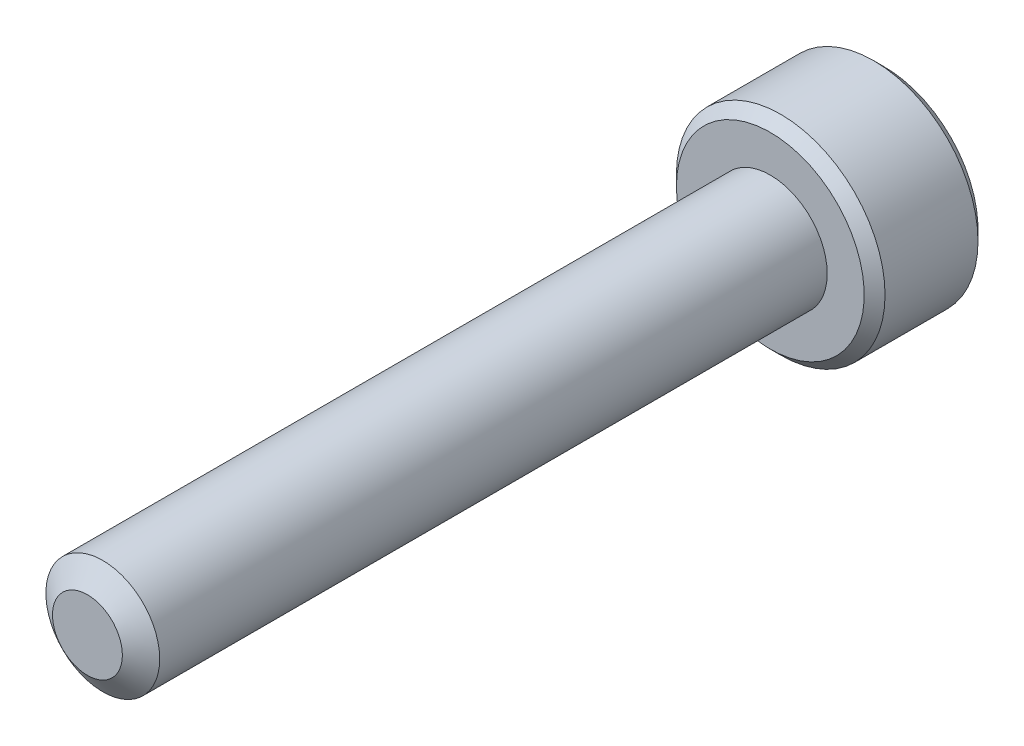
ISO-10303-21;
HEADER;
FILE_DESCRIPTION(('STEP AP214'),'2;1');
FILE_NAME('part.step','',(''),(''),'','','');
FILE_SCHEMA(('AUTOMOTIVE_DESIGN { 1 0 10303 214 1 1 1 1 }'));
ENDSEC;
DATA;
#1=APPLICATION_CONTEXT('core data for automotive mechanical design processes');
#2=APPLICATION_PROTOCOL_DEFINITION('international standard','automotive_design',2000,#1);
#3=PRODUCT_CONTEXT('',#1,'mechanical');
#4=PRODUCT('Part','Part','',(#3));
#5=PRODUCT_RELATED_PRODUCT_CATEGORY('part','',(#4));
#6=PRODUCT_DEFINITION_FORMATION('','',#4);
#7=PRODUCT_DEFINITION_CONTEXT('part definition',#1,'design');
#8=PRODUCT_DEFINITION('design','',#6,#7);
#9=PRODUCT_DEFINITION_SHAPE('','',#8);
#10=(LENGTH_UNIT() NAMED_UNIT(*) SI_UNIT(.MILLI.,.METRE.));
#11=(NAMED_UNIT(*) PLANE_ANGLE_UNIT() SI_UNIT($,.RADIAN.));
#12=(NAMED_UNIT(*) SI_UNIT($,.STERADIAN.) SOLID_ANGLE_UNIT());
#13=UNCERTAINTY_MEASURE_WITH_UNIT(LENGTH_MEASURE(1.E-05),#10,'distance_accuracy_value','');
#14=(GEOMETRIC_REPRESENTATION_CONTEXT(3) GLOBAL_UNCERTAINTY_ASSIGNED_CONTEXT((#13)) GLOBAL_UNIT_ASSIGNED_CONTEXT((#10,
#11,#12)) REPRESENTATION_CONTEXT('',''));
#15=CARTESIAN_POINT('',(0.,0.,0.));
#16=DIRECTION('',(0.,0.,1.));
#17=DIRECTION('',(1.,0.,0.));
#18=AXIS2_PLACEMENT_3D('',#15,#16,#17);
#19=CARTESIAN_POINT('',(0.,0.,-18.));
#20=DIRECTION('',(0.,0.,1.));
#21=DIRECTION('',(1.,0.,0.));
#22=AXIS2_PLACEMENT_3D('',#19,#20,#21);
#23=CYLINDRICAL_SURFACE('',#22,1.5);
#24=CARTESIAN_POINT('',(0.,0.,-18.));
#25=DIRECTION('',(0.,0.,-1.));
#26=DIRECTION('',(-1.,0.,0.));
#27=AXIS2_PLACEMENT_3D('',#24,#25,#26);
#28=CIRCLE('',#27,1.5);
#29=CARTESIAN_POINT('',(-1.5,0.,-18.));
#30=VERTEX_POINT('',#29);
#31=EDGE_CURVE('E211',#30,#30,#28,.F.);
#32=ORIENTED_EDGE('',*,*,#31,.T.);
#33=EDGE_LOOP('',(#32));
#34=FACE_BOUND('',#33,.T.);
#35=CARTESIAN_POINT('',(0.,0.,-0.405251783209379));
#36=DIRECTION('',(0.,0.,1.));
#37=DIRECTION('',(1.,0.,0.));
#38=AXIS2_PLACEMENT_3D('',#35,#36,#37);
#39=CIRCLE('',#38,1.5);
#40=CARTESIAN_POINT('',(1.5,0.,-0.405251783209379));
#41=VERTEX_POINT('',#40);
#42=EDGE_CURVE('E108',#41,#41,#39,.T.);
#43=ORIENTED_EDGE('',*,*,#42,.F.);
#44=EDGE_LOOP('',(#43));
#45=FACE_BOUND('',#44,.T.);
#46=ADVANCED_FACE('F34',(#34,#45),#23,.T.);
#47=CARTESIAN_POINT('',(0.,0.,0.));
#48=DIRECTION('',(0.,0.,-1.));
#49=DIRECTION('',(-1.,0.,0.));
#50=AXIS2_PLACEMENT_3D('',#47,#48,#49);
#51=CONICAL_SURFACE('',#50,0.921240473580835,0.959931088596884);
#52=ORIENTED_EDGE('',*,*,#42,.T.);
#53=EDGE_LOOP('',(#52));
#54=FACE_BOUND('',#53,.T.);
#55=CARTESIAN_POINT('',(0.,0.,0.));
#56=DIRECTION('',(0.,0.,1.));
#57=DIRECTION('',(1.,0.,0.));
#58=AXIS2_PLACEMENT_3D('',#55,#56,#57);
#59=CIRCLE('',#58,0.921240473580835);
#60=CARTESIAN_POINT('',(0.921240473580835,0.,0.));
#61=VERTEX_POINT('',#60);
#62=EDGE_CURVE('E209',#61,#61,#59,.T.);
#63=ORIENTED_EDGE('',*,*,#62,.F.);
#64=EDGE_LOOP('',(#63));
#65=FACE_BOUND('',#64,.T.);
#66=ADVANCED_FACE('F192',(#54,#65),#51,.T.);
#67=CARTESIAN_POINT('',(0.,0.,0.));
#68=DIRECTION('',(0.,0.,1.));
#69=DIRECTION('',(1.,0.,0.));
#70=AXIS2_PLACEMENT_3D('',#67,#68,#69);
#71=PLANE('',#70);
#72=ORIENTED_EDGE('',*,*,#62,.T.);
#73=EDGE_LOOP('',(#72));
#74=FACE_BOUND('',#73,.T.);
#75=ADVANCED_FACE('F189',(#74),#71,.T.);
#76=CARTESIAN_POINT('',(0.,0.,-21.));
#77=DIRECTION('',(0.,0.,1.));
#78=DIRECTION('',(1.,0.,0.));
#79=AXIS2_PLACEMENT_3D('',#76,#77,#78);
#80=CYLINDRICAL_SURFACE('',#79,2.75);
#81=CARTESIAN_POINT('',(0.,0.,-20.725));
#82=DIRECTION('',(0.,0.,-1.));
#83=DIRECTION('',(-1.,0.,0.));
#84=AXIS2_PLACEMENT_3D('',#81,#82,#83);
#85=CIRCLE('',#84,2.75);
#86=CARTESIAN_POINT('',(-2.75,0.,-20.725));
#87=VERTEX_POINT('',#86);
#88=EDGE_CURVE('E42',#87,#87,#85,.F.);
#89=ORIENTED_EDGE('',*,*,#88,.T.);
#90=EDGE_LOOP('',(#89));
#91=FACE_BOUND('',#90,.T.);
#92=CARTESIAN_POINT('',(0.,0.,-18.275));
#93=DIRECTION('',(0.,0.,-1.));
#94=DIRECTION('',(-1.,0.,0.));
#95=AXIS2_PLACEMENT_3D('',#92,#93,#94);
#96=CIRCLE('',#95,2.75);
#97=CARTESIAN_POINT('',(-2.75,0.,-18.275));
#98=VERTEX_POINT('',#97);
#99=EDGE_CURVE('E168',#98,#98,#96,.T.);
#100=ORIENTED_EDGE('',*,*,#99,.T.);
#101=EDGE_LOOP('',(#100));
#102=FACE_BOUND('',#101,.T.);
#103=ADVANCED_FACE('F173',(#91,#102),#80,.T.);
#104=CARTESIAN_POINT('',(0.,0.,-21.));
#105=DIRECTION('',(0.,0.,-1.));
#106=DIRECTION('',(-1.,0.,0.));
#107=AXIS2_PLACEMENT_3D('',#104,#105,#106);
#108=PLANE('',#107);
#109=CARTESIAN_POINT('',(0.,0.,-21.));
#110=DIRECTION('',(0.,0.,-1.));
#111=DIRECTION('',(-1.,0.,0.));
#112=AXIS2_PLACEMENT_3D('',#109,#110,#111);
#113=CIRCLE('',#112,2.47499999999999);
#114=CARTESIAN_POINT('',(-2.47499999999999,0.,-21.));
#115=VERTEX_POINT('',#114);
#116=EDGE_CURVE('E107',#115,#115,#113,.T.);
#117=ORIENTED_EDGE('',*,*,#116,.T.);
#118=EDGE_LOOP('',(#117));
#119=FACE_BOUND('',#118,.T.);
#120=CARTESIAN_POINT('',(0.,0.,-21.));
#121=DIRECTION('',(0.,0.,-1.));
#122=DIRECTION('',(-1.,0.,0.));
#123=AXIS2_PLACEMENT_3D('',#120,#121,#122);
#124=CIRCLE('',#123,1.44337567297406);
#125=CARTESIAN_POINT('',(-1.25,0.721687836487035,-21.));
#126=VERTEX_POINT('',#125);
#127=CARTESIAN_POINT('',(0.,1.44337567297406,-21.));
#128=VERTEX_POINT('',#127);
#129=EDGE_CURVE('E88',#126,#128,#124,.T.);
#130=ORIENTED_EDGE('',*,*,#129,.F.);
#131=CARTESIAN_POINT('',(-1.25,-0.721687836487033,-21.));
#132=VERTEX_POINT('',#131);
#133=EDGE_CURVE('E48',#132,#126,#124,.T.);
#134=ORIENTED_EDGE('',*,*,#133,.F.);
#135=CARTESIAN_POINT('',(0.,-1.44337567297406,-21.));
#136=VERTEX_POINT('',#135);
#137=EDGE_CURVE('E267',#136,#132,#124,.T.);
#138=ORIENTED_EDGE('',*,*,#137,.F.);
#139=CARTESIAN_POINT('',(1.25,-0.721687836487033,-21.));
#140=VERTEX_POINT('',#139);
#141=EDGE_CURVE('E55',#140,#136,#124,.T.);
#142=ORIENTED_EDGE('',*,*,#141,.F.);
#143=CARTESIAN_POINT('',(1.25,0.721687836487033,-21.));
#144=VERTEX_POINT('',#143);
#145=EDGE_CURVE('E129',#144,#140,#124,.T.);
#146=ORIENTED_EDGE('',*,*,#145,.F.);
#147=EDGE_CURVE('E97',#128,#144,#124,.T.);
#148=ORIENTED_EDGE('',*,*,#147,.F.);
#149=EDGE_LOOP('',(#130,#134,#138,#142,#146,#148));
#150=FACE_BOUND('',#149,.T.);
#151=ADVANCED_FACE('F128',(#119,#150),#108,.T.);
#152=CARTESIAN_POINT('',(0.,0.,-18.));
#153=DIRECTION('',(0.,0.,-1.));
#154=DIRECTION('',(-1.,0.,0.));
#155=AXIS2_PLACEMENT_3D('',#152,#153,#154);
#156=PLANE('',#155);
#157=CARTESIAN_POINT('',(0.,0.,-18.));
#158=DIRECTION('',(0.,0.,-1.));
#159=DIRECTION('',(-1.,0.,0.));
#160=AXIS2_PLACEMENT_3D('',#157,#158,#159);
#161=CIRCLE('',#160,2.475);
#162=CARTESIAN_POINT('',(-2.475,0.,-18.));
#163=VERTEX_POINT('',#162);
#164=EDGE_CURVE('E11',#163,#163,#161,.F.);
#165=ORIENTED_EDGE('',*,*,#164,.T.);
#166=EDGE_LOOP('',(#165));
#167=FACE_BOUND('',#166,.T.);
#168=ORIENTED_EDGE('',*,*,#31,.F.);
#169=EDGE_LOOP('',(#168));
#170=FACE_BOUND('',#169,.T.);
#171=ADVANCED_FACE('F182',(#167,#170),#156,.F.);
#172=CARTESIAN_POINT('',(0.,0.,-21.));
#173=DIRECTION('',(0.,0.,-1.));
#174=DIRECTION('',(-1.,0.,0.));
#175=AXIS2_PLACEMENT_3D('',#172,#173,#174);
#176=CONICAL_SURFACE('',#175,1.44337567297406,0.78539816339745);
#177=ORIENTED_EDGE('',*,*,#147,.T.);
#178=CARTESIAN_POINT('',(-0.000200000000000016,1.4434911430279,-21.0001154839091));
#179=CARTESIAN_POINT('',(0.0427751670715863,1.41867941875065,-20.9753216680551));
#180=CARTESIAN_POINT('',(0.086469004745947,1.39345276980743,-20.9519837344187));
#181=CARTESIAN_POINT('',(0.17556593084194,1.34201263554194,-20.9092520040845));
#182=CARTESIAN_POINT('',(0.220977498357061,1.31579425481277,-20.8898819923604));
#183=CARTESIAN_POINT('',(0.312547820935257,1.26292610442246,-20.8567004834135));
#184=CARTESIAN_POINT('',(0.358683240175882,1.23628980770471,-20.8428055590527));
#185=CARTESIAN_POINT('',(0.451970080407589,1.18243062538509,-20.8213972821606));
#186=CARTESIAN_POINT('',(0.499118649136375,1.15520938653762,-20.8138679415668));
#187=CARTESIAN_POINT('',(0.580373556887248,1.10829684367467,-20.8070744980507));
#188=CARTESIAN_POINT('',(0.614374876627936,1.08866617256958,-20.8060685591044));
#189=CARTESIAN_POINT('',(0.682317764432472,1.04943932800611,-20.8077614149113));
#190=CARTESIAN_POINT('',(0.716259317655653,1.029843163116,-20.8104610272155));
#191=CARTESIAN_POINT('',(0.783814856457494,0.990839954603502,-20.8194089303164));
#192=CARTESIAN_POINT('',(0.81742850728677,0.971433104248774,-20.8256605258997));
#193=CARTESIAN_POINT('',(0.884094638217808,0.932943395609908,-20.8413756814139));
#194=CARTESIAN_POINT('',(0.91714687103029,0.913860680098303,-20.8508406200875));
#195=CARTESIAN_POINT('',(1.00179969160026,0.86498635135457,-20.8789313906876));
#196=CARTESIAN_POINT('',(1.05286649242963,0.835502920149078,-20.8996701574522));
#197=CARTESIAN_POINT('',(1.15300085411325,0.77769031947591,-20.9463871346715));
#198=CARTESIAN_POINT('',(1.20207431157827,0.749357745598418,-20.9723482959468));
#199=CARTESIAN_POINT('',(1.2502,0.721572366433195,-21.0001154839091));
#200=B_SPLINE_CURVE_WITH_KNOTS('',3,(#178,#179,#180,#181,#182,#183,#184,#185,#186,#187,#188,
#189,#190,#191,#192,#193,#194,#195,#196,#197,#198,#199),.UNSPECIFIED.,.F.,.F.,(4,2,2,2,2,2,2,2,
2,2,4),(0.,0.166533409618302,0.334037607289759,0.498880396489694,0.663307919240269,
0.780963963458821,0.898645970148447,1.01643764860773,1.13427993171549,1.3214865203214,
1.50809158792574),.UNSPECIFIED.);
#201=EDGE_CURVE('E102',#128,#144,#200,.T.);
#202=ORIENTED_EDGE('',*,*,#201,.F.);
#203=EDGE_LOOP('',(#177,#202));
#204=FACE_BOUND('',#203,.T.);
#205=ADVANCED_FACE('F103',(#204),#176,.F.);
#206=ORIENTED_EDGE('',*,*,#145,.T.);
#207=CARTESIAN_POINT('',(1.25,-1.43934010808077,-21.4629820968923));
#208=CARTESIAN_POINT('',(1.25,-1.40429313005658,-21.4365249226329));
#209=CARTESIAN_POINT('',(1.25,-1.36905087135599,-21.4103271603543));
#210=CARTESIAN_POINT('',(1.25,-1.29809650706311,-21.3585575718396));
#211=CARTESIAN_POINT('',(1.25,-1.26238428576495,-21.3329859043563));
#212=CARTESIAN_POINT('',(1.25,-1.15390111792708,-21.2570059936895));
#213=CARTESIAN_POINT('',(1.25,-1.08031646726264,-21.2077402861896));
#214=CARTESIAN_POINT('',(1.25,-0.926012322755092,-21.1110258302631));
#215=CARTESIAN_POINT('',(1.25,-0.845125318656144,-21.0638412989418));
#216=CARTESIAN_POINT('',(1.25,-0.679311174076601,-20.9775307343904));
#217=CARTESIAN_POINT('',(1.25,-0.594398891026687,-20.9383775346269));
#218=CARTESIAN_POINT('',(1.25,-0.466944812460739,-20.8904772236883));
#219=CARTESIAN_POINT('',(1.25,-0.42628998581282,-20.8767294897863));
#220=CARTESIAN_POINT('',(1.25,-0.343998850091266,-20.8524979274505));
#221=CARTESIAN_POINT('',(1.25,-0.302362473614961,-20.8420143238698));
#222=CARTESIAN_POINT('',(1.25,-0.219052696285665,-20.8250301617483));
#223=CARTESIAN_POINT('',(1.25,-0.177393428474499,-20.8184613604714));
#224=CARTESIAN_POINT('',(1.25,-0.093629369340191,-20.8094350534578));
#225=CARTESIAN_POINT('',(1.25,-0.051524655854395,-20.8069768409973));
#226=CARTESIAN_POINT('',(1.25,0.0311890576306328,-20.8063540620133));
#227=CARTESIAN_POINT('',(1.25,0.0717969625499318,-20.8080371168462));
#228=CARTESIAN_POINT('',(1.25,0.152668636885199,-20.8152682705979));
#229=CARTESIAN_POINT('',(1.25,0.19293233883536,-20.8208171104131));
#230=CARTESIAN_POINT('',(1.25,0.273499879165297,-20.835571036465));
#231=CARTESIAN_POINT('',(1.25,0.313792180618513,-20.8448381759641));
#232=CARTESIAN_POINT('',(1.25,0.393496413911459,-20.8665361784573));
#233=CARTESIAN_POINT('',(1.25,0.432908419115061,-20.8789667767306));
#234=CARTESIAN_POINT('',(1.25,0.5569927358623,-20.9227793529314));
#235=CARTESIAN_POINT('',(1.25,0.639898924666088,-20.959151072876));
#236=CARTESIAN_POINT('',(1.25,0.801816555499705,-21.0400191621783));
#237=CARTESIAN_POINT('',(1.25,0.880812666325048,-21.084544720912));
#238=CARTESIAN_POINT('',(1.25,1.0317856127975,-21.1764048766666));
#239=CARTESIAN_POINT('',(1.25,1.10391618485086,-21.2234899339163));
#240=CARTESIAN_POINT('',(1.25,1.21018606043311,-21.2962785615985));
#241=CARTESIAN_POINT('',(1.25,1.2451506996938,-21.3207980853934));
#242=CARTESIAN_POINT('',(1.25,1.31460220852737,-21.3704856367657));
#243=CARTESIAN_POINT('',(1.25,1.34908920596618,-21.3956534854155));
#244=CARTESIAN_POINT('',(1.25,1.38337731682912,-21.4210901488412));
#245=B_SPLINE_CURVE_WITH_KNOTS('',3,(#207,#208,#209,#210,#211,#212,#213,#214,#215,#216,#217,
#218,#219,#220,#221,#222,#223,#224,#225,#226,#227,#228,#229,#230,#231,#232,#233,#234,#235,#236,
#237,#238,#239,#240,#241,#242,#243,#244),.UNSPECIFIED.,.F.,.F.,(4,2,2,2,2,2,2,2,2,2,2,2,2,2,2,2,
2,2,4),(0.,0.131732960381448,0.263498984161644,0.529042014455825,0.809741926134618,
1.08947609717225,1.21811634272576,1.346765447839,1.47310084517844,1.59941451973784,
1.72115042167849,1.84290966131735,1.96679153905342,2.09066305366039,2.36146692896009,
2.63325989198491,2.8915466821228,3.01965734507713,3.14773302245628),.UNSPECIFIED.);
#246=EDGE_CURVE('E96',#144,#140,#245,.F.);
#247=ORIENTED_EDGE('',*,*,#246,.F.);
#248=EDGE_LOOP('',(#206,#247));
#249=FACE_BOUND('',#248,.T.);
#250=ADVANCED_FACE('F273',(#249),#176,.F.);
#251=ORIENTED_EDGE('',*,*,#141,.T.);
#252=CARTESIAN_POINT('',(1.2502,-0.721572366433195,-21.0001154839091));
#253=CARTESIAN_POINT('',(1.20722483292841,-0.746384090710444,-20.9753216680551));
#254=CARTESIAN_POINT('',(1.16353099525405,-0.771610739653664,-20.9519837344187));
#255=CARTESIAN_POINT('',(1.07443406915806,-0.823050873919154,-20.9092520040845));
#256=CARTESIAN_POINT('',(1.02902250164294,-0.849269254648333,-20.8898819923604));
#257=CARTESIAN_POINT('',(0.937452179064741,-0.902137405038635,-20.8567004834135));
#258=CARTESIAN_POINT('',(0.891316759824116,-0.928773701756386,-20.8428055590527));
#259=CARTESIAN_POINT('',(0.79802991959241,-0.982632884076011,-20.8213972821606));
#260=CARTESIAN_POINT('',(0.750881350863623,-1.00985412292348,-20.8138679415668));
#261=CARTESIAN_POINT('',(0.669626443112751,-1.05676666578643,-20.8070744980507));
#262=CARTESIAN_POINT('',(0.635625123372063,-1.07639733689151,-20.8060685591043));
#263=CARTESIAN_POINT('',(0.567682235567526,-1.11562418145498,-20.8077614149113));
#264=CARTESIAN_POINT('',(0.533740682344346,-1.1352203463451,-20.8104610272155));
#265=CARTESIAN_POINT('',(0.466185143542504,-1.17422355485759,-20.8194089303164));
#266=CARTESIAN_POINT('',(0.432571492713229,-1.19363040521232,-20.8256605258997));
#267=CARTESIAN_POINT('',(0.365905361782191,-1.23212011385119,-20.8413756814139));
#268=CARTESIAN_POINT('',(0.332853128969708,-1.25120282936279,-20.8508406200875));
#269=CARTESIAN_POINT('',(0.248200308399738,-1.30007715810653,-20.8789313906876));
#270=CARTESIAN_POINT('',(0.197133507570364,-1.32956058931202,-20.8996701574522));
#271=CARTESIAN_POINT('',(0.0969991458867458,-1.38737318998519,-20.9463871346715));
#272=CARTESIAN_POINT('',(0.0479256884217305,-1.41570576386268,-20.9723482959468));
#273=CARTESIAN_POINT('',(-0.000200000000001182,-1.4434911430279,-21.0001154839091));
#274=B_SPLINE_CURVE_WITH_KNOTS('',3,(#252,#253,#254,#255,#256,#257,#258,#259,#260,#261,#262,
#263,#264,#265,#266,#267,#268,#269,#270,#271,#272,#273),.UNSPECIFIED.,.F.,.F.,(4,2,2,2,2,2,2,2,
2,2,4),(0.,0.1665334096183,0.334037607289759,0.498880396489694,0.663307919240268,
0.78096396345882,0.898645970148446,1.01643764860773,1.13427993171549,1.3214865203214,
1.50809158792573),.UNSPECIFIED.);
#275=EDGE_CURVE('E138',#140,#136,#274,.T.);
#276=ORIENTED_EDGE('',*,*,#275,.F.);
#277=EDGE_LOOP('',(#251,#276));
#278=FACE_BOUND('',#277,.T.);
#279=ADVANCED_FACE('F270',(#278),#176,.F.);
#280=ORIENTED_EDGE('',*,*,#137,.T.);
#281=CARTESIAN_POINT('',(0.000200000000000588,-1.4434911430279,-21.0001154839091));
#282=CARTESIAN_POINT('',(-0.0427751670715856,-1.41867941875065,-20.9753216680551));
#283=CARTESIAN_POINT('',(-0.0864690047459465,-1.39345276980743,-20.9519837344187));
#284=CARTESIAN_POINT('',(-0.17556593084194,-1.34201263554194,-20.9092520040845));
#285=CARTESIAN_POINT('',(-0.220977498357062,-1.31579425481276,-20.8898819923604));
#286=CARTESIAN_POINT('',(-0.312547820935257,-1.26292610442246,-20.8567004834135));
#287=CARTESIAN_POINT('',(-0.358683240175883,-1.23628980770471,-20.8428055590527));
#288=CARTESIAN_POINT('',(-0.45197008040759,-1.18243062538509,-20.8213972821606));
#289=CARTESIAN_POINT('',(-0.499118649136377,-1.15520938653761,-20.8138679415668));
#290=CARTESIAN_POINT('',(-0.58037355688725,-1.10829684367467,-20.8070744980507));
#291=CARTESIAN_POINT('',(-0.614374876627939,-1.08866617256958,-20.8060685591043));
#292=CARTESIAN_POINT('',(-0.682317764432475,-1.04943932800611,-20.8077614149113));
#293=CARTESIAN_POINT('',(-0.716259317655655,-1.02984316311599,-20.8104610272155));
#294=CARTESIAN_POINT('',(-0.783814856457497,-0.9908399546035,-20.8194089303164));
#295=CARTESIAN_POINT('',(-0.817428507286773,-0.971433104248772,-20.8256605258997));
#296=CARTESIAN_POINT('',(-0.884094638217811,-0.932943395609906,-20.8413756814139));
#297=CARTESIAN_POINT('',(-0.917146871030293,-0.913860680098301,-20.8508406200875));
#298=CARTESIAN_POINT('',(-1.00179969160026,-0.864986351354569,-20.8789313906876));
#299=CARTESIAN_POINT('',(-1.05286649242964,-0.835502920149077,-20.8996701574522));
#300=CARTESIAN_POINT('',(-1.15300085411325,-0.77769031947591,-20.9463871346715));
#301=CARTESIAN_POINT('',(-1.20207431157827,-0.749357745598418,-20.9723482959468));
#302=CARTESIAN_POINT('',(-1.2502,-0.721572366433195,-21.0001154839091));
#303=B_SPLINE_CURVE_WITH_KNOTS('',3,(#281,#282,#283,#284,#285,#286,#287,#288,#289,#290,#291,
#292,#293,#294,#295,#296,#297,#298,#299,#300,#301,#302),.UNSPECIFIED.,.F.,.F.,(4,2,2,2,2,2,2,2,
2,2,4),(0.,0.166533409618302,0.33403760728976,0.498880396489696,0.663307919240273,
0.780963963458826,0.898645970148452,1.01643764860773,1.13427993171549,1.3214865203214,
1.50809158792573),.UNSPECIFIED.);
#304=EDGE_CURVE('E245',#136,#132,#303,.T.);
#305=ORIENTED_EDGE('',*,*,#304,.F.);
#306=EDGE_LOOP('',(#280,#305));
#307=FACE_BOUND('',#306,.T.);
#308=ADVANCED_FACE('F269',(#307),#176,.F.);
#309=ORIENTED_EDGE('',*,*,#133,.T.);
#310=CARTESIAN_POINT('',(-1.25,-1.43934010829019,-21.4629820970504));
#311=CARTESIAN_POINT('',(-1.25,-1.40429313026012,-21.4365249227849));
#312=CARTESIAN_POINT('',(-1.25,-1.36905087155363,-21.4103271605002));
#313=CARTESIAN_POINT('',(-1.25,-1.2980965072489,-21.3585575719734));
#314=CARTESIAN_POINT('',(-1.25,-1.2623842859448,-21.3329859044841));
#315=CARTESIAN_POINT('',(-1.25,-1.1539011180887,-21.257005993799));
#316=CARTESIAN_POINT('',(-1.25,-1.08031646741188,-21.207740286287));
#317=CARTESIAN_POINT('',(-1.25,-0.926012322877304,-21.1110258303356));
#318=CARTESIAN_POINT('',(-1.25,-0.84512531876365,-21.0638412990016));
#319=CARTESIAN_POINT('',(-1.25,-0.679311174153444,-20.9775307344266));
#320=CARTESIAN_POINT('',(-1.25,-0.594398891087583,-20.9383775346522));
#321=CARTESIAN_POINT('',(-1.25,-0.466944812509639,-20.8904772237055));
#322=CARTESIAN_POINT('',(-1.25,-0.426289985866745,-20.8767294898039));
#323=CARTESIAN_POINT('',(-1.25,-0.343998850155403,-20.8524979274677));
#324=CARTESIAN_POINT('',(-1.25,-0.302362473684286,-20.8420143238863));
#325=CARTESIAN_POINT('',(-1.25,-0.219052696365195,-20.8250301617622));
#326=CARTESIAN_POINT('',(-1.25,-0.177393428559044,-20.8184613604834));
#327=CARTESIAN_POINT('',(-1.25,-0.0936293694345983,-20.809435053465));
#328=CARTESIAN_POINT('',(-1.25,-0.051524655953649,-20.8069768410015));
#329=CARTESIAN_POINT('',(-1.25,0.0311890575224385,-20.8063540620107));
#330=CARTESIAN_POINT('',(-1.25,0.0717969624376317,-20.8080371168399));
#331=CARTESIAN_POINT('',(-1.25,0.152668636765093,-20.8152682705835));
#332=CARTESIAN_POINT('',(-1.25,0.192932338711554,-20.8208171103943));
#333=CARTESIAN_POINT('',(-1.25,0.273499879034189,-20.835571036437));
#334=CARTESIAN_POINT('',(-1.25,0.313792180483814,-20.8448381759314));
#335=CARTESIAN_POINT('',(-1.25,0.393496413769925,-20.8665361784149));
#336=CARTESIAN_POINT('',(-1.25,0.432908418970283,-20.8789667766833));
#337=CARTESIAN_POINT('',(-1.25,0.556992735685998,-20.9227793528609));
#338=CARTESIAN_POINT('',(-1.25,0.639898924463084,-20.9591510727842));
#339=CARTESIAN_POINT('',(-1.25,0.801816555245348,-21.0400191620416));
#340=CARTESIAN_POINT('',(-1.25,0.880812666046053,-21.0845447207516));
#341=CARTESIAN_POINT('',(-1.25,1.03178561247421,-21.176404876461));
#342=CARTESIAN_POINT('',(-1.25,1.10391618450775,-21.2234899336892));
#343=CARTESIAN_POINT('',(-1.25,1.2101860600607,-21.2962785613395));
#344=CARTESIAN_POINT('',(-1.25,1.24515069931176,-21.3207980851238));
#345=CARTESIAN_POINT('',(-1.25,1.31460220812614,-21.3704856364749));
#346=CARTESIAN_POINT('',(-1.25,1.3490892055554,-21.3956534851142));
#347=CARTESIAN_POINT('',(-1.25,1.38337731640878,-21.4210901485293));
#348=B_SPLINE_CURVE_WITH_KNOTS('',3,(#310,#311,#312,#313,#314,#315,#316,#317,#318,#319,#320,
#321,#322,#323,#324,#325,#326,#327,#328,#329,#330,#331,#332,#333,#334,#335,#336,#337,#338,#339,
#340,#341,#342,#343,#344,#345,#346,#347),.UNSPECIFIED.,.F.,.F.,(4,2,2,2,2,2,2,2,2,2,2,2,2,2,2,2,
2,2,4),(0.,0.131732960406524,0.263498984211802,0.529042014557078,0.809741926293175,
1.08947609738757,1.21811634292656,1.34676544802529,1.47310084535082,1.59941451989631,
1.72115042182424,1.84290966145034,1.96679153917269,2.09066305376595,2.36146692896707,
2.63325989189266,2.89154668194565,3.01965734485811,3.14773302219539),.UNSPECIFIED.);
#349=EDGE_CURVE('E118',#132,#126,#348,.T.);
#350=ORIENTED_EDGE('',*,*,#349,.F.);
#351=EDGE_LOOP('',(#309,#350));
#352=FACE_BOUND('',#351,.T.);
#353=ADVANCED_FACE('F282',(#352),#176,.F.);
#354=ORIENTED_EDGE('',*,*,#129,.T.);
#355=CARTESIAN_POINT('',(-1.2502,0.721572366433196,-21.0001154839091));
#356=CARTESIAN_POINT('',(-1.20722483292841,0.746384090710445,-20.9753216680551));
#357=CARTESIAN_POINT('',(-1.16353099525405,0.771610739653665,-20.9519837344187));
#358=CARTESIAN_POINT('',(-1.07443406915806,0.823050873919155,-20.9092520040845));
#359=CARTESIAN_POINT('',(-1.02902250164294,0.849269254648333,-20.8898819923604));
#360=CARTESIAN_POINT('',(-0.93745217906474,0.902137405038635,-20.8567004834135));
#361=CARTESIAN_POINT('',(-0.891316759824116,0.928773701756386,-20.8428055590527));
#362=CARTESIAN_POINT('',(-0.79802991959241,0.982632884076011,-20.8213972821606));
#363=CARTESIAN_POINT('',(-0.750881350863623,1.00985412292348,-20.8138679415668));
#364=CARTESIAN_POINT('',(-0.66962644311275,1.05676666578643,-20.8070744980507));
#365=CARTESIAN_POINT('',(-0.635625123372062,1.07639733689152,-20.8060685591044));
#366=CARTESIAN_POINT('',(-0.567682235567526,1.11562418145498,-20.8077614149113));
#367=CARTESIAN_POINT('',(-0.533740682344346,1.1352203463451,-20.8104610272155));
#368=CARTESIAN_POINT('',(-0.466185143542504,1.1742235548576,-20.8194089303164));
#369=CARTESIAN_POINT('',(-0.432571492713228,1.19363040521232,-20.8256605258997));
#370=CARTESIAN_POINT('',(-0.36590536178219,1.23212011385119,-20.8413756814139));
#371=CARTESIAN_POINT('',(-0.332853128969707,1.25120282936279,-20.8508406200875));
#372=CARTESIAN_POINT('',(-0.248200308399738,1.30007715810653,-20.8789313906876));
#373=CARTESIAN_POINT('',(-0.197133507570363,1.32956058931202,-20.8996701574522));
#374=CARTESIAN_POINT('',(-0.0969991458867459,1.38737318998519,-20.9463871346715));
#375=CARTESIAN_POINT('',(-0.0479256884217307,1.41570576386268,-20.9723482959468));
#376=CARTESIAN_POINT('',(0.000200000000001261,1.4434911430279,-21.0001154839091));
#377=B_SPLINE_CURVE_WITH_KNOTS('',3,(#355,#356,#357,#358,#359,#360,#361,#362,#363,#364,#365,
#366,#367,#368,#369,#370,#371,#372,#373,#374,#375,#376),.UNSPECIFIED.,.F.,.F.,(4,2,2,2,2,2,2,2,
2,2,4),(0.,0.1665334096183,0.334037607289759,0.498880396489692,0.663307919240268,
0.78096396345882,0.898645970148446,1.01643764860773,1.13427993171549,1.3214865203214,
1.50809158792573),.UNSPECIFIED.);
#378=EDGE_CURVE('E92',#126,#128,#377,.T.);
#379=ORIENTED_EDGE('',*,*,#378,.F.);
#380=EDGE_LOOP('',(#354,#379));
#381=FACE_BOUND('',#380,.T.);
#382=ADVANCED_FACE('F90',(#381),#176,.F.);
#383=CARTESIAN_POINT('',(1.25,2.1650635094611,-19.125));
#384=DIRECTION('',(0.,0.,-1.));
#385=DIRECTION('',(-1.,0.,0.));
#386=AXIS2_PLACEMENT_3D('',#383,#384,#385);
#387=PLANE('',#386);
#388=DIRECTION('',(0.866025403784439,0.5,0.));
#389=VECTOR('',#388,1.);
#390=CARTESIAN_POINT('',(-1.25,0.721687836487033,-19.125));
#391=LINE('',#390,#389);
#392=CARTESIAN_POINT('',(-1.25,0.721687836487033,-19.125));
#393=VERTEX_POINT('',#392);
#394=CARTESIAN_POINT('',(0.,1.44337567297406,-19.125));
#395=VERTEX_POINT('',#394);
#396=EDGE_CURVE('E117',#393,#395,#391,.T.);
#397=ORIENTED_EDGE('',*,*,#396,.T.);
#398=DIRECTION('',(0.866025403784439,-0.5,0.));
#399=VECTOR('',#398,1.);
#400=CARTESIAN_POINT('',(0.,1.44337567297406,-19.125));
#401=LINE('',#400,#399);
#402=CARTESIAN_POINT('',(1.25,0.721687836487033,-19.125));
#403=VERTEX_POINT('',#402);
#404=EDGE_CURVE('E122',#395,#403,#401,.T.);
#405=ORIENTED_EDGE('',*,*,#404,.T.);
#406=DIRECTION('',(0.,-1.,0.));
#407=VECTOR('',#406,1.);
#408=CARTESIAN_POINT('',(1.25,0.721687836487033,-19.125));
#409=LINE('',#408,#407);
#410=CARTESIAN_POINT('',(1.25,-0.721687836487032,-19.125));
#411=VERTEX_POINT('',#410);
#412=EDGE_CURVE('E233',#403,#411,#409,.T.);
#413=ORIENTED_EDGE('',*,*,#412,.T.);
#414=DIRECTION('',(-0.866025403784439,-0.5,0.));
#415=VECTOR('',#414,1.);
#416=CARTESIAN_POINT('',(1.25,-0.721687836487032,-19.125));
#417=LINE('',#416,#415);
#418=CARTESIAN_POINT('',(0.,-1.44337567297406,-19.125));
#419=VERTEX_POINT('',#418);
#420=EDGE_CURVE('E230',#411,#419,#417,.T.);
#421=ORIENTED_EDGE('',*,*,#420,.T.);
#422=DIRECTION('',(-0.866025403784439,0.5,0.));
#423=VECTOR('',#422,1.);
#424=CARTESIAN_POINT('',(0.,-1.44337567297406,-19.125));
#425=LINE('',#424,#423);
#426=CARTESIAN_POINT('',(-1.25,-0.721687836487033,-19.125));
#427=VERTEX_POINT('',#426);
#428=EDGE_CURVE('E227',#419,#427,#425,.T.);
#429=ORIENTED_EDGE('',*,*,#428,.T.);
#430=DIRECTION('',(0.,1.,0.));
#431=VECTOR('',#430,1.);
#432=CARTESIAN_POINT('',(-1.25,-0.721687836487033,-19.125));
#433=LINE('',#432,#431);
#434=EDGE_CURVE('E125',#427,#393,#433,.T.);
#435=ORIENTED_EDGE('',*,*,#434,.T.);
#436=EDGE_LOOP('',(#397,#405,#413,#421,#429,#435));
#437=FACE_BOUND('',#436,.T.);
#438=ADVANCED_FACE('F157',(#437),#387,.T.);
#439=CARTESIAN_POINT('',(0.,1.44337567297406,-19.125));
#440=DIRECTION('',(0.5,0.866025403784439,0.));
#441=DIRECTION('',(-0.866025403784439,0.5,0.));
#442=AXIS2_PLACEMENT_3D('',#439,#440,#441);
#443=PLANE('',#442);
#444=DIRECTION('',(0.,0.,-1.));
#445=VECTOR('',#444,1.);
#446=CARTESIAN_POINT('',(0.,1.44337567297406,-19.125));
#447=LINE('',#446,#445);
#448=EDGE_CURVE('E114',#395,#128,#447,.T.);
#449=ORIENTED_EDGE('',*,*,#448,.T.);
#450=ORIENTED_EDGE('',*,*,#201,.T.);
#451=DIRECTION('',(0.,0.,-1.));
#452=VECTOR('',#451,1.);
#453=CARTESIAN_POINT('',(1.25,0.721687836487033,-19.125));
#454=LINE('',#453,#452);
#455=EDGE_CURVE('E124',#403,#144,#454,.T.);
#456=ORIENTED_EDGE('',*,*,#455,.F.);
#457=ORIENTED_EDGE('',*,*,#404,.F.);
#458=EDGE_LOOP('',(#449,#450,#456,#457));
#459=FACE_BOUND('',#458,.T.);
#460=ADVANCED_FACE('F120',(#459),#443,.F.);
#461=CARTESIAN_POINT('',(1.25,0.721687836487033,-19.125));
#462=DIRECTION('',(1.,0.,0.));
#463=DIRECTION('',(0.,0.,-1.));
#464=AXIS2_PLACEMENT_3D('',#461,#462,#463);
#465=PLANE('',#464);
#466=ORIENTED_EDGE('',*,*,#455,.T.);
#467=ORIENTED_EDGE('',*,*,#246,.T.);
#468=DIRECTION('',(0.,0.,-1.));
#469=VECTOR('',#468,1.);
#470=CARTESIAN_POINT('',(1.25,-0.721687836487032,-19.125));
#471=LINE('',#470,#469);
#472=EDGE_CURVE('E216',#411,#140,#471,.T.);
#473=ORIENTED_EDGE('',*,*,#472,.F.);
#474=ORIENTED_EDGE('',*,*,#412,.F.);
#475=EDGE_LOOP('',(#466,#467,#473,#474));
#476=FACE_BOUND('',#475,.T.);
#477=ADVANCED_FACE('F146',(#476),#465,.F.);
#478=CARTESIAN_POINT('',(1.25,-0.721687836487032,-19.125));
#479=DIRECTION('',(0.5,-0.866025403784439,0.));
#480=DIRECTION('',(0.866025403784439,0.5,0.));
#481=AXIS2_PLACEMENT_3D('',#478,#479,#480);
#482=PLANE('',#481);
#483=ORIENTED_EDGE('',*,*,#472,.T.);
#484=ORIENTED_EDGE('',*,*,#275,.T.);
#485=DIRECTION('',(0.,0.,-1.));
#486=VECTOR('',#485,1.);
#487=CARTESIAN_POINT('',(0.,-1.44337567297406,-19.125));
#488=LINE('',#487,#486);
#489=EDGE_CURVE('E219',#419,#136,#488,.T.);
#490=ORIENTED_EDGE('',*,*,#489,.F.);
#491=ORIENTED_EDGE('',*,*,#420,.F.);
#492=EDGE_LOOP('',(#483,#484,#490,#491));
#493=FACE_BOUND('',#492,.T.);
#494=ADVANCED_FACE('F150',(#493),#482,.F.);
#495=CARTESIAN_POINT('',(0.,-1.44337567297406,-19.125));
#496=DIRECTION('',(-0.5,-0.866025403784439,0.));
#497=DIRECTION('',(0.866025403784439,-0.5,0.));
#498=AXIS2_PLACEMENT_3D('',#495,#496,#497);
#499=PLANE('',#498);
#500=ORIENTED_EDGE('',*,*,#489,.T.);
#501=ORIENTED_EDGE('',*,*,#304,.T.);
#502=DIRECTION('',(0.,0.,-1.));
#503=VECTOR('',#502,1.);
#504=CARTESIAN_POINT('',(-1.25,-0.721687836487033,-19.125));
#505=LINE('',#504,#503);
#506=EDGE_CURVE('E222',#427,#132,#505,.T.);
#507=ORIENTED_EDGE('',*,*,#506,.F.);
#508=ORIENTED_EDGE('',*,*,#428,.F.);
#509=EDGE_LOOP('',(#500,#501,#507,#508));
#510=FACE_BOUND('',#509,.T.);
#511=ADVANCED_FACE('F252',(#510),#499,.F.);
#512=CARTESIAN_POINT('',(-1.25,-0.721687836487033,-19.125));
#513=DIRECTION('',(-1.,0.,0.));
#514=DIRECTION('',(0.,-1.,0.));
#515=AXIS2_PLACEMENT_3D('',#512,#513,#514);
#516=PLANE('',#515);
#517=ORIENTED_EDGE('',*,*,#506,.T.);
#518=ORIENTED_EDGE('',*,*,#349,.T.);
#519=DIRECTION('',(0.,0.,-1.));
#520=VECTOR('',#519,1.);
#521=CARTESIAN_POINT('',(-1.25,0.721687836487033,-19.125));
#522=LINE('',#521,#520);
#523=EDGE_CURVE('E116',#393,#126,#522,.T.);
#524=ORIENTED_EDGE('',*,*,#523,.F.);
#525=ORIENTED_EDGE('',*,*,#434,.F.);
#526=EDGE_LOOP('',(#517,#518,#524,#525));
#527=FACE_BOUND('',#526,.T.);
#528=ADVANCED_FACE('F249',(#527),#516,.F.);
#529=CARTESIAN_POINT('',(-1.25,0.721687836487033,-19.125));
#530=DIRECTION('',(-0.5,0.866025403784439,0.));
#531=DIRECTION('',(-0.866025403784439,-0.5,0.));
#532=AXIS2_PLACEMENT_3D('',#529,#530,#531);
#533=PLANE('',#532);
#534=ORIENTED_EDGE('',*,*,#523,.T.);
#535=ORIENTED_EDGE('',*,*,#378,.T.);
#536=ORIENTED_EDGE('',*,*,#448,.F.);
#537=ORIENTED_EDGE('',*,*,#396,.F.);
#538=EDGE_LOOP('',(#534,#535,#536,#537));
#539=FACE_BOUND('',#538,.T.);
#540=ADVANCED_FACE('F112',(#539),#533,.F.);
#541=CARTESIAN_POINT('',(0.,0.,-21.));
#542=DIRECTION('',(0.,0.,1.));
#543=DIRECTION('',(1.,0.,0.));
#544=AXIS2_PLACEMENT_3D('',#541,#542,#543);
#545=CONICAL_SURFACE('',#544,2.47499999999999,0.78539816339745);
#546=ORIENTED_EDGE('',*,*,#88,.F.);
#547=EDGE_LOOP('',(#546));
#548=FACE_BOUND('',#547,.T.);
#549=ORIENTED_EDGE('',*,*,#116,.F.);
#550=EDGE_LOOP('',(#549));
#551=FACE_BOUND('',#550,.T.);
#552=ADVANCED_FACE('F176',(#548,#551),#545,.T.);
#553=CARTESIAN_POINT('',(0.,0.,-18.275));
#554=DIRECTION('',(0.,0.,-1.));
#555=DIRECTION('',(-1.,0.,0.));
#556=AXIS2_PLACEMENT_3D('',#553,#554,#555);
#557=CONICAL_SURFACE('',#556,2.75,0.785398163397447);
#558=CARTESIAN_POINT('',(-2.475,0.,-18.));
#559=CARTESIAN_POINT('',(-2.47786458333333,0.,-18.0028645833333));
#560=CARTESIAN_POINT('',(-2.48072916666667,0.,-18.0057291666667));
#561=CARTESIAN_POINT('',(-2.48645833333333,0.,-18.0114583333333));
#562=CARTESIAN_POINT('',(-2.48932291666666,0.,-18.0143229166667));
#563=CARTESIAN_POINT('',(-2.49505208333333,0.,-18.0200520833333));
#564=CARTESIAN_POINT('',(-2.49791666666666,0.,-18.0229166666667));
#565=CARTESIAN_POINT('',(-2.50364583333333,0.,-18.0286458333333));
#566=CARTESIAN_POINT('',(-2.50651041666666,0.,-18.0315104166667));
#567=CARTESIAN_POINT('',(-2.51223958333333,0.,-18.0372395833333));
#568=CARTESIAN_POINT('',(-2.51510416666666,0.,-18.0401041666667));
#569=CARTESIAN_POINT('',(-2.52083333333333,0.,-18.0458333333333));
#570=CARTESIAN_POINT('',(-2.52369791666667,0.,-18.0486979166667));
#571=CARTESIAN_POINT('',(-2.52942708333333,0.,-18.0544270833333));
#572=CARTESIAN_POINT('',(-2.53229166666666,0.,-18.0572916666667));
#573=CARTESIAN_POINT('',(-2.53802083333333,0.,-18.0630208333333));
#574=CARTESIAN_POINT('',(-2.54088541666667,0.,-18.0658854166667));
#575=CARTESIAN_POINT('',(-2.54661458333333,0.,-18.0716145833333));
#576=CARTESIAN_POINT('',(-2.54947916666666,0.,-18.0744791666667));
#577=CARTESIAN_POINT('',(-2.55520833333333,0.,-18.0802083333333));
#578=CARTESIAN_POINT('',(-2.55807291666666,0.,-18.0830729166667));
#579=CARTESIAN_POINT('',(-2.56380208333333,0.,-18.0888020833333));
#580=CARTESIAN_POINT('',(-2.56666666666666,0.,-18.0916666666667));
#581=CARTESIAN_POINT('',(-2.57239583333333,0.,-18.0973958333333));
#582=CARTESIAN_POINT('',(-2.57526041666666,0.,-18.1002604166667));
#583=CARTESIAN_POINT('',(-2.58098958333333,0.,-18.1059895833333));
#584=CARTESIAN_POINT('',(-2.58385416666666,0.,-18.1088541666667));
#585=CARTESIAN_POINT('',(-2.58958333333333,0.,-18.1145833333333));
#586=CARTESIAN_POINT('',(-2.59244791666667,0.,-18.1174479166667));
#587=CARTESIAN_POINT('',(-2.59817708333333,0.,-18.1231770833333));
#588=CARTESIAN_POINT('',(-2.60104166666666,0.,-18.1260416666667));
#589=CARTESIAN_POINT('',(-2.60677083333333,0.,-18.1317708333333));
#590=CARTESIAN_POINT('',(-2.60963541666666,0.,-18.1346354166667));
#591=CARTESIAN_POINT('',(-2.61536458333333,0.,-18.1403645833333));
#592=CARTESIAN_POINT('',(-2.61822916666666,0.,-18.1432291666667));
#593=CARTESIAN_POINT('',(-2.62395833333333,0.,-18.1489583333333));
#594=CARTESIAN_POINT('',(-2.62682291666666,0.,-18.1518229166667));
#595=CARTESIAN_POINT('',(-2.63255208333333,0.,-18.1575520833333));
#596=CARTESIAN_POINT('',(-2.63541666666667,0.,-18.1604166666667));
#597=CARTESIAN_POINT('',(-2.64114583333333,0.,-18.1661458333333));
#598=CARTESIAN_POINT('',(-2.64401041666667,0.,-18.1690104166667));
#599=CARTESIAN_POINT('',(-2.64973958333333,0.,-18.1747395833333));
#600=CARTESIAN_POINT('',(-2.65260416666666,0.,-18.1776041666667));
#601=CARTESIAN_POINT('',(-2.65833333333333,0.,-18.1833333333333));
#602=CARTESIAN_POINT('',(-2.66119791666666,0.,-18.1861979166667));
#603=CARTESIAN_POINT('',(-2.66692708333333,0.,-18.1919270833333));
#604=CARTESIAN_POINT('',(-2.66979166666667,0.,-18.1947916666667));
#605=CARTESIAN_POINT('',(-2.67552083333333,0.,-18.2005208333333));
#606=CARTESIAN_POINT('',(-2.67838541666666,0.,-18.2033854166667));
#607=CARTESIAN_POINT('',(-2.68411458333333,0.,-18.2091145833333));
#608=CARTESIAN_POINT('',(-2.68697916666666,0.,-18.2119791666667));
#609=CARTESIAN_POINT('',(-2.69270833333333,0.,-18.2177083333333));
#610=CARTESIAN_POINT('',(-2.69557291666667,0.,-18.2205729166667));
#611=CARTESIAN_POINT('',(-2.70130208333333,0.,-18.2263020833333));
#612=CARTESIAN_POINT('',(-2.70416666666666,0.,-18.2291666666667));
#613=CARTESIAN_POINT('',(-2.70989583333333,0.,-18.2348958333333));
#614=CARTESIAN_POINT('',(-2.71276041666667,0.,-18.2377604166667));
#615=CARTESIAN_POINT('',(-2.71848958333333,0.,-18.2434895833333));
#616=CARTESIAN_POINT('',(-2.72135416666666,0.,-18.2463541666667));
#617=CARTESIAN_POINT('',(-2.72708333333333,0.,-18.2520833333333));
#618=CARTESIAN_POINT('',(-2.72994791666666,0.,-18.2549479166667));
#619=CARTESIAN_POINT('',(-2.73567708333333,0.,-18.2606770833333));
#620=CARTESIAN_POINT('',(-2.73854166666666,0.,-18.2635416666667));
#621=CARTESIAN_POINT('',(-2.74427083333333,0.,-18.2692708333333));
#622=CARTESIAN_POINT('',(-2.74713541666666,0.,-18.2721354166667));
#623=CARTESIAN_POINT('',(-2.75,0.,-18.275));
#624=B_SPLINE_CURVE_WITH_KNOTS('',3,(#558,#559,#560,#561,#562,#563,#564,#565,#566,#567,#568,
#569,#570,#571,#572,#573,#574,#575,#576,#577,#578,#579,#580,#581,#582,#583,#584,#585,#586,#587,
#588,#589,#590,#591,#592,#593,#594,#595,#596,#597,#598,#599,#600,#601,#602,#603,#604,#605,#606,
#607,#608,#609,#610,#611,#612,#613,#614,#615,#616,#617,#618,#619,#620,#621,#622,#623),
.UNSPECIFIED.,.F.,.F.,(4,2,2,2,2,2,2,2,2,2,2,2,2,2,2,2,2,2,2,2,2,2,2,2,2,2,2,2,2,2,2,2,4),(0.,
0.0121533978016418,0.0243067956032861,0.0364601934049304,0.048613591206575,0.0607669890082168,
0.0729203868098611,0.0850737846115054,0.09722718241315,0.109380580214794,0.121533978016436,
0.13368737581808,0.145840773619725,0.157994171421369,0.170147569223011,0.182300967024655,
0.1944543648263,0.206607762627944,0.218761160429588,0.23091455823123,0.243067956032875,
0.255221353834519,0.267374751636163,0.279528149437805,0.291681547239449,0.303834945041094,
0.315988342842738,0.328141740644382,0.340295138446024,0.352448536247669,0.364601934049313,
0.376755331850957,0.388908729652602),.UNSPECIFIED.);
#625=EDGE_CURVE('BSEAM36',#163,#98,#624,.T.);
#626=ORIENTED_EDGE('',*,*,#164,.F.);
#627=ORIENTED_EDGE('',*,*,#99,.F.);
#628=ORIENTED_EDGE('',*,*,#625,.T.);
#629=ORIENTED_EDGE('',*,*,#625,.F.);
#630=EDGE_LOOP('',(#626,#628,#627,#629));
#631=FACE_BOUND('',#630,.T.);
#632=ADVANCED_FACE('F36',(#631),#557,.T.);
#633=CLOSED_SHELL('',(#46,#66,#75,#103,#151,#171,#205,#250,#279,#308,#353,#382,#438,#460,#477,
#494,#511,#528,#540,#552,#632));
#634=MANIFOLD_SOLID_BREP('B2',#633);
#635=ADVANCED_BREP_SHAPE_REPRESENTATION('',(#18,#634),#14);
#636=SHAPE_DEFINITION_REPRESENTATION(#9,#635);
ENDSEC;
END-ISO-10303-21;
